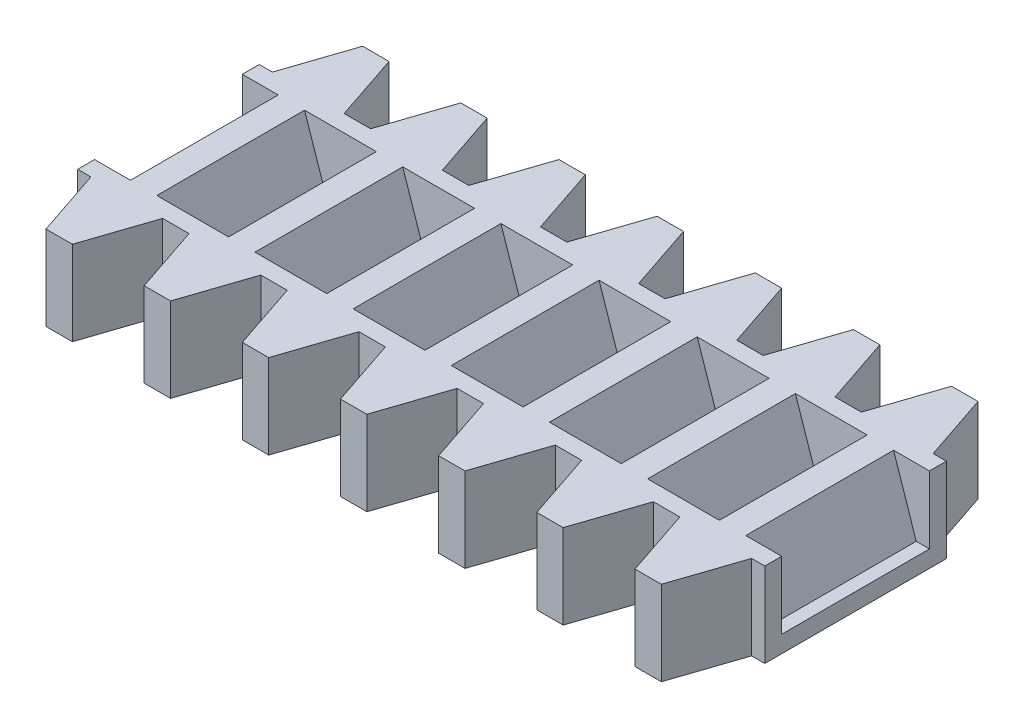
from build123d import *

# Parameters (mm, degrees)
SKETCH_1_W                    = 4.65
SKETCH_1_H                    = 8.6
EXTRUDE_1_DEPTH               = 4
EXTRUDE_2_DEPTH               = 4
CUT_EXTRUDE_1_DEPTH           = 3.5
PATTERN_LINEAR_4_COUNT        = 7
PATTERN_LINEAR_4_PITCH        = 4.65
PATTERN_LINEAR_4_COPY_1_DEPTH = 4
PATTERN_LINEAR_4_COPY_2_DEPTH = 4
PATTERN_LINEAR_4_COPY_3_DEPTH = 4
PATTERN_LINEAR_4_COPY_4_DEPTH = 4
PATTERN_LINEAR_4_COPY_5_DEPTH = 4
PATTERN_LINEAR_4_COPY_6_DEPTH = 4
EXTRUDE_START                 = 1
EXTRUDE_4_DEPTH               = 25.9
FILLET_1_R                    = 0.1


with BuildPart() as part:
    # Sketch 1 → Extrude 1 (new body)
    with BuildSketch(Plane(origin=(0, 0, 0), x_dir=(1, 0, 0), z_dir=(0, 1, 0))):
        Rectangle(SKETCH_1_W, SKETCH_1_H)
    extrude_1 = extrude(amount=EXTRUDE_1_DEPTH)

    # Sketch 3 → Extrude 2 (add)
    with BuildSketch(Plane(origin=(0, 0, 0), x_dir=(1, 0, 0), z_dir=(0, 1, 0))):
        Polygon((0.625, 7.5), (-0.625, 7.5), (-1.7, 4.3), (1.7, 4.3), align=None)
    extrude_2 = extrude(amount=EXTRUDE_2_DEPTH)

    # Mirror 1: Extrude 2 across plane
    add(extrude_2.mirror(Plane.XY))

    # Sketch 4 → Cut-Extrude 1 (cut, symmetric)
    with BuildSketch(Plane.XY):
        Polygon((-0.625, 4), (-2.325, 4), (-2.325, 0.8), (-1.7, 0.8), align=None)
        Polygon((1.7, 0.8), (2.325, 0.8), (2.325, 4), (0.625, 4), align=None)
    cut_extrude_1 = extrude(amount=CUT_EXTRUDE_1_DEPTH, both=True, mode=Mode.SUBTRACT)

    # Pattern Linear 4: Extrude 1, Extrude 2, Cut-Extrude 1 ×7
    with Locations(*[(i * PATTERN_LINEAR_4_PITCH, 0, 0) for i in range(1, PATTERN_LINEAR_4_COUNT)]):
        add(extrude_1)
        add(extrude_2)
        add(cut_extrude_1, mode=Mode.SUBTRACT)

    # Pattern Linear 4 copy 1 sketch → Pattern Linear 4 copy 1 (add)
    with BuildSketch(Plane(origin=(4.65, 0, 0), x_dir=(1, 0, 0), z_dir=(0, 1, 0))):
        Polygon((0.625, -7.5), (-0.625, -7.5), (-1.7, -4.3), (1.7, -4.3), align=None)
    extrude(amount=PATTERN_LINEAR_4_COPY_1_DEPTH)

    # Pattern Linear 4 copy 2 sketch → Pattern Linear 4 copy 2 (add)
    with BuildSketch(Plane(origin=(9.3, 0, 0), x_dir=(1, 0, 0), z_dir=(0, 1, 0))):
        Polygon((0.625, -7.5), (-0.625, -7.5), (-1.7, -4.3), (1.7, -4.3), align=None)
    extrude(amount=PATTERN_LINEAR_4_COPY_2_DEPTH)

    # Pattern Linear 4 copy 3 sketch → Pattern Linear 4 copy 3 (add)
    with BuildSketch(Plane(origin=(13.95, 0, 0), x_dir=(1, 0, 0), z_dir=(0, 1, 0))):
        Polygon((0.625, -7.5), (-0.625, -7.5), (-1.7, -4.3), (1.7, -4.3), align=None)
    extrude(amount=PATTERN_LINEAR_4_COPY_3_DEPTH)

    # Pattern Linear 4 copy 4 sketch → Pattern Linear 4 copy 4 (add)
    with BuildSketch(Plane(origin=(18.6, 0, 0), x_dir=(1, 0, 0), z_dir=(0, 1, 0))):
        Polygon((0.625, -7.5), (-0.625, -7.5), (-1.7, -4.3), (1.7, -4.3), align=None)
    extrude(amount=PATTERN_LINEAR_4_COPY_4_DEPTH)

    # Pattern Linear 4 copy 5 sketch → Pattern Linear 4 copy 5 (add)
    with BuildSketch(Plane(origin=(23.25, 0, 0), x_dir=(1, 0, 0), z_dir=(0, 1, 0))):
        Polygon((0.625, -7.5), (-0.625, -7.5), (-1.7, -4.3), (1.7, -4.3), align=None)
    extrude(amount=PATTERN_LINEAR_4_COPY_5_DEPTH)

    # Pattern Linear 4 copy 6 sketch → Pattern Linear 4 copy 6 (add)
    with BuildSketch(Plane(origin=(27.9, 0, 0), x_dir=(1, 0, 0), z_dir=(0, 1, 0))):
        Polygon((0.625, -7.5), (-0.625, -7.5), (-1.7, -4.3), (1.7, -4.3), align=None)
    extrude(amount=PATTERN_LINEAR_4_COPY_6_DEPTH)

    # Sketch 6 → Extrude 4 (add)
    with BuildSketch(Plane(origin=(0, 0, 0), x_dir=(0, 0, -1), z_dir=(1, 0, 0)).offset(EXTRUDE_START)):
        with BuildLine():
            Line((1.5, 0), (0.5, 0))
            Line((0.5, 0), (0.5, -1.07225346))
            Line((0.5, -1.07225346), (1.165769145, -2.5))
            Line((1.165769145, -2.5), (1.95, -2.5))
            Line((1.95, -2.5), (1.95, -1.555590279))
            ThreePointArc((1.95, -1.555590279), (1.780042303, -1.088161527), (1.5, -0.677124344))
            Line((1.5, -0.677124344), (1.5, 0))
        make_face()
        with BuildLine():
            Line((-0.5, -1.07225346), (-1.165769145, -2.5))
            Line((-1.165769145, -2.5), (-1.95, -2.5))
            Line((-1.95, -2.5), (-1.95, -1.555590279))
            ThreePointArc((-1.95, -1.555590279), (-1.780042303, -1.088161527), (-1.5, -0.677124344))
            Line((-1.5, -0.677124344), (-1.5, 0))
            Line((-1.5, 0), (-0.5, 0))
            Line((-0.5, 0), (-0.5, -1.07225346))
        make_face()
    extrude(amount=EXTRUDE_4_DEPTH)

    # Fillet 1
    fillet_1_edges = [part.edges().sort_by_distance(p)[0] for p in [
        (1, -2.5, -1.557884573),
        (13.95, -2.5, -1.165769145),
        (13.95, -2.5, -1.95),
        (26.9, -2.5, -1.557884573),
        (1, -2.5, 1.557884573),
        (13.95, -2.5, 1.95),
        (13.95, -2.5, 1.165769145),
        (26.9, -2.5, 1.557884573),
    ]]
    fillet(fillet_1_edges, radius=FILLET_1_R)


solid = part.part
